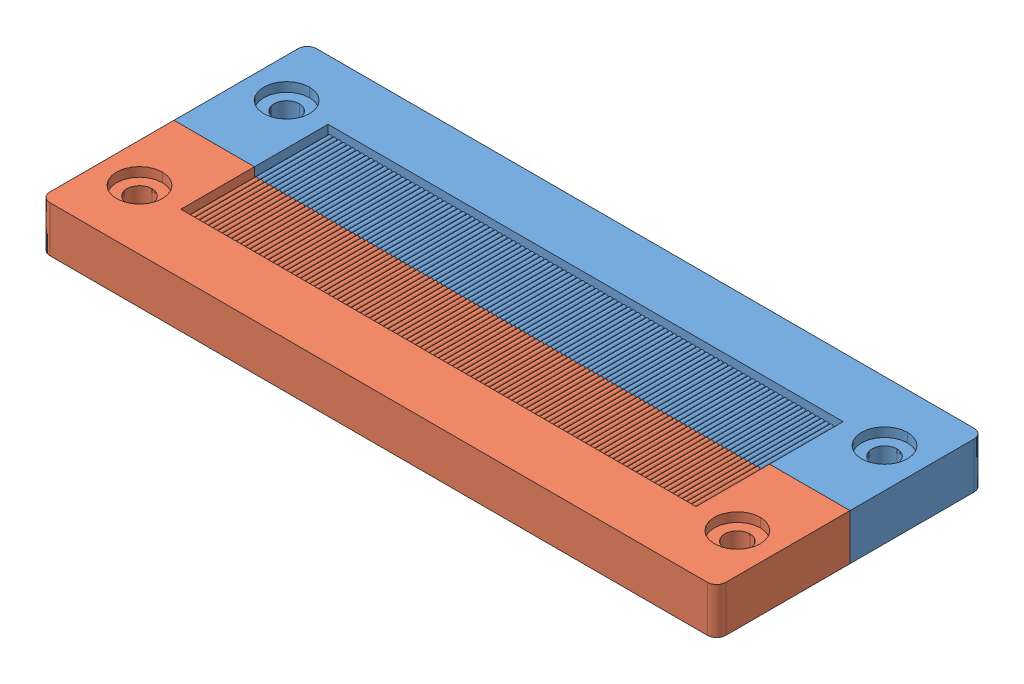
SolidWorks assembly 51522.SLDASM, configuration Default (file format 8000). Lengths in mm.
Overall size (147 10 58).
2 component instances, 2 part files, 0 mates.
Components (placement in the parent):
- 51522_01-1: 51522_01.SLDPRT [Default] at origin size (147 10 29)
- 51522_02-1: 51522_02.SLDPRT [Default] at origin size (147 10 29)
